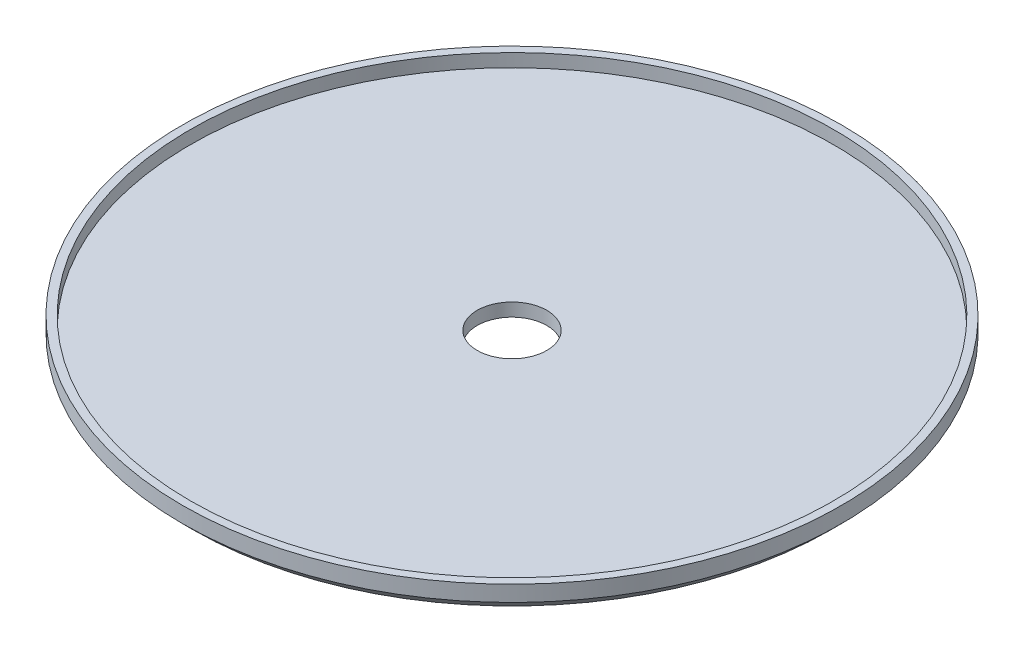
ISO-10303-21;
HEADER;
FILE_DESCRIPTION(('STEP AP214'),'2;1');
FILE_NAME('part.step','',(''),(''),'','','');
FILE_SCHEMA(('AUTOMOTIVE_DESIGN { 1 0 10303 214 1 1 1 1 }'));
ENDSEC;
DATA;
#1=APPLICATION_CONTEXT('core data for automotive mechanical design processes');
#2=APPLICATION_PROTOCOL_DEFINITION('international standard','automotive_design',2000,#1);
#3=PRODUCT_CONTEXT('',#1,'mechanical');
#4=PRODUCT('Part','Part','',(#3));
#5=PRODUCT_RELATED_PRODUCT_CATEGORY('part','',(#4));
#6=PRODUCT_DEFINITION_FORMATION('','',#4);
#7=PRODUCT_DEFINITION_CONTEXT('part definition',#1,'design');
#8=PRODUCT_DEFINITION('design','',#6,#7);
#9=PRODUCT_DEFINITION_SHAPE('','',#8);
#10=(LENGTH_UNIT() NAMED_UNIT(*) SI_UNIT(.MILLI.,.METRE.));
#11=(NAMED_UNIT(*) PLANE_ANGLE_UNIT() SI_UNIT($,.RADIAN.));
#12=(NAMED_UNIT(*) SI_UNIT($,.STERADIAN.) SOLID_ANGLE_UNIT());
#13=UNCERTAINTY_MEASURE_WITH_UNIT(LENGTH_MEASURE(1.E-05),#10,'distance_accuracy_value','');
#14=(GEOMETRIC_REPRESENTATION_CONTEXT(3) GLOBAL_UNCERTAINTY_ASSIGNED_CONTEXT((#13)) GLOBAL_UNIT_ASSIGNED_CONTEXT((#10,
#11,#12)) REPRESENTATION_CONTEXT('',''));
#15=CARTESIAN_POINT('',(0.,0.,0.));
#16=DIRECTION('',(0.,0.,1.));
#17=DIRECTION('',(1.,0.,0.));
#18=AXIS2_PLACEMENT_3D('',#15,#16,#17);
#19=CARTESIAN_POINT('',(0.,12.7,0.));
#20=DIRECTION('',(0.,-1.,0.));
#21=DIRECTION('',(0.,0.,-1.));
#22=AXIS2_PLACEMENT_3D('',#19,#20,#21);
#23=CYLINDRICAL_SURFACE('',#22,158.75);
#24=CARTESIAN_POINT('',(0.,5.07999999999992,0.));
#25=DIRECTION('',(0.,1.,0.));
#26=DIRECTION('',(0.,0.,1.));
#27=AXIS2_PLACEMENT_3D('',#24,#25,#26);
#28=CIRCLE('',#27,158.75);
#29=CARTESIAN_POINT('',(0.,5.07999999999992,158.75));
#30=VERTEX_POINT('',#29);
#31=EDGE_CURVE('E37',#30,#30,#28,.T.);
#32=ORIENTED_EDGE('',*,*,#31,.T.);
#33=EDGE_LOOP('',(#32));
#34=FACE_BOUND('',#33,.T.);
#35=CARTESIAN_POINT('',(0.,12.7,0.));
#36=DIRECTION('',(0.,1.,0.));
#37=DIRECTION('',(0.,0.,1.));
#38=AXIS2_PLACEMENT_3D('',#35,#36,#37);
#39=CIRCLE('',#38,158.75);
#40=CARTESIAN_POINT('',(0.,12.7,158.75));
#41=VERTEX_POINT('',#40);
#42=EDGE_CURVE('E41',#41,#41,#39,.T.);
#43=ORIENTED_EDGE('',*,*,#42,.F.);
#44=EDGE_LOOP('',(#43));
#45=FACE_BOUND('',#44,.T.);
#46=ADVANCED_FACE('F31',(#34,#45),#23,.T.);
#47=CARTESIAN_POINT('',(0.,12.7,0.));
#48=DIRECTION('',(0.,1.,0.));
#49=DIRECTION('',(0.,0.,1.));
#50=AXIS2_PLACEMENT_3D('',#47,#48,#49);
#51=PLANE('',#50);
#52=CARTESIAN_POINT('',(0.,12.7,0.));
#53=DIRECTION('',(0.,1.,0.));
#54=DIRECTION('',(0.,0.,1.));
#55=AXIS2_PLACEMENT_3D('',#52,#53,#54);
#56=CIRCLE('',#55,154.94);
#57=CARTESIAN_POINT('',(0.,12.7,154.94));
#58=VERTEX_POINT('',#57);
#59=EDGE_CURVE('E50',#58,#58,#56,.T.);
#60=ORIENTED_EDGE('',*,*,#59,.F.);
#61=EDGE_LOOP('',(#60));
#62=FACE_BOUND('',#61,.T.);
#63=ORIENTED_EDGE('',*,*,#42,.T.);
#64=EDGE_LOOP('',(#63));
#65=FACE_BOUND('',#64,.T.);
#66=ADVANCED_FACE('F65',(#62,#65),#51,.T.);
#67=CARTESIAN_POINT('',(0.,0.,0.));
#68=DIRECTION('',(0.,1.,0.));
#69=DIRECTION('',(0.,0.,1.));
#70=AXIS2_PLACEMENT_3D('',#67,#68,#69);
#71=PLANE('',#70);
#72=CARTESIAN_POINT('',(0.,0.,0.));
#73=DIRECTION('',(0.,1.,0.));
#74=DIRECTION('',(0.,0.,1.));
#75=AXIS2_PLACEMENT_3D('',#72,#73,#74);
#76=CIRCLE('',#75,153.67);
#77=CARTESIAN_POINT('',(0.,0.,153.67));
#78=VERTEX_POINT('',#77);
#79=EDGE_CURVE('E10',#78,#78,#76,.F.);
#80=ORIENTED_EDGE('',*,*,#79,.T.);
#81=EDGE_LOOP('',(#80));
#82=FACE_BOUND('',#81,.T.);
#83=CARTESIAN_POINT('',(0.,0.,0.));
#84=DIRECTION('',(0.,-1.,0.));
#85=DIRECTION('',(0.,0.,-1.));
#86=AXIS2_PLACEMENT_3D('',#83,#84,#85);
#87=CIRCLE('',#86,16.764);
#88=CARTESIAN_POINT('',(0.,0.,-16.764));
#89=VERTEX_POINT('',#88);
#90=EDGE_CURVE('E51',#89,#89,#87,.T.);
#91=ORIENTED_EDGE('',*,*,#90,.F.);
#92=EDGE_LOOP('',(#91));
#93=FACE_BOUND('',#92,.T.);
#94=ADVANCED_FACE('F62',(#82,#93),#71,.F.);
#95=CARTESIAN_POINT('',(0.,6.35,0.));
#96=DIRECTION('',(0.,1.,0.));
#97=DIRECTION('',(0.,0.,1.));
#98=AXIS2_PLACEMENT_3D('',#95,#96,#97);
#99=CYLINDRICAL_SURFACE('',#98,154.94);
#100=CARTESIAN_POINT('',(0.,6.35,0.));
#101=DIRECTION('',(0.,1.,0.));
#102=DIRECTION('',(0.,0.,1.));
#103=AXIS2_PLACEMENT_3D('',#100,#101,#102);
#104=CIRCLE('',#103,154.94);
#105=CARTESIAN_POINT('',(0.,6.35,154.94));
#106=VERTEX_POINT('',#105);
#107=EDGE_CURVE('E45',#106,#106,#104,.T.);
#108=ORIENTED_EDGE('',*,*,#107,.F.);
#109=EDGE_LOOP('',(#108));
#110=FACE_BOUND('',#109,.T.);
#111=ORIENTED_EDGE('',*,*,#59,.T.);
#112=EDGE_LOOP('',(#111));
#113=FACE_BOUND('',#112,.T.);
#114=ADVANCED_FACE('F64',(#110,#113),#99,.F.);
#115=CARTESIAN_POINT('',(0.,6.35,0.));
#116=DIRECTION('',(0.,1.,0.));
#117=DIRECTION('',(0.,0.,1.));
#118=AXIS2_PLACEMENT_3D('',#115,#116,#117);
#119=PLANE('',#118);
#120=CARTESIAN_POINT('',(0.,6.35,0.));
#121=DIRECTION('',(0.,1.,0.));
#122=DIRECTION('',(0.,0.,1.));
#123=AXIS2_PLACEMENT_3D('',#120,#121,#122);
#124=CIRCLE('',#123,16.764);
#125=CARTESIAN_POINT('',(0.,6.35,16.764));
#126=VERTEX_POINT('',#125);
#127=EDGE_CURVE('E48',#126,#126,#124,.T.);
#128=ORIENTED_EDGE('',*,*,#127,.F.);
#129=EDGE_LOOP('',(#128));
#130=FACE_BOUND('',#129,.T.);
#131=ORIENTED_EDGE('',*,*,#107,.T.);
#132=EDGE_LOOP('',(#131));
#133=FACE_BOUND('',#132,.T.);
#134=ADVANCED_FACE('F71',(#130,#133),#119,.T.);
#135=CARTESIAN_POINT('',(0.,12.7,0.));
#136=DIRECTION('',(0.,-1.,0.));
#137=DIRECTION('',(0.,0.,-1.));
#138=AXIS2_PLACEMENT_3D('',#135,#136,#137);
#139=CYLINDRICAL_SURFACE('',#138,16.764);
#140=ORIENTED_EDGE('',*,*,#127,.T.);
#141=EDGE_LOOP('',(#140));
#142=FACE_BOUND('',#141,.T.);
#143=ORIENTED_EDGE('',*,*,#90,.T.);
#144=EDGE_LOOP('',(#143));
#145=FACE_BOUND('',#144,.T.);
#146=ADVANCED_FACE('F60',(#142,#145),#139,.F.);
#147=CARTESIAN_POINT('',(0.,5.07999999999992,0.));
#148=DIRECTION('',(0.,1.,0.));
#149=DIRECTION('',(0.,0.,1.));
#150=AXIS2_PLACEMENT_3D('',#147,#148,#149);
#151=CONICAL_SURFACE('',#150,158.75,0.785398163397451);
#152=ORIENTED_EDGE('',*,*,#79,.F.);
#153=EDGE_LOOP('',(#152));
#154=FACE_BOUND('',#153,.T.);
#155=ORIENTED_EDGE('',*,*,#31,.F.);
#156=EDGE_LOOP('',(#155));
#157=FACE_BOUND('',#156,.T.);
#158=ADVANCED_FACE('F109',(#154,#157),#151,.T.);
#159=CLOSED_SHELL('',(#46,#66,#94,#114,#134,#146,#158));
#160=MANIFOLD_SOLID_BREP('B2',#159);
#161=ADVANCED_BREP_SHAPE_REPRESENTATION('',(#18,#160),#14);
#162=SHAPE_DEFINITION_REPRESENTATION(#9,#161);
ENDSEC;
END-ISO-10303-21;
